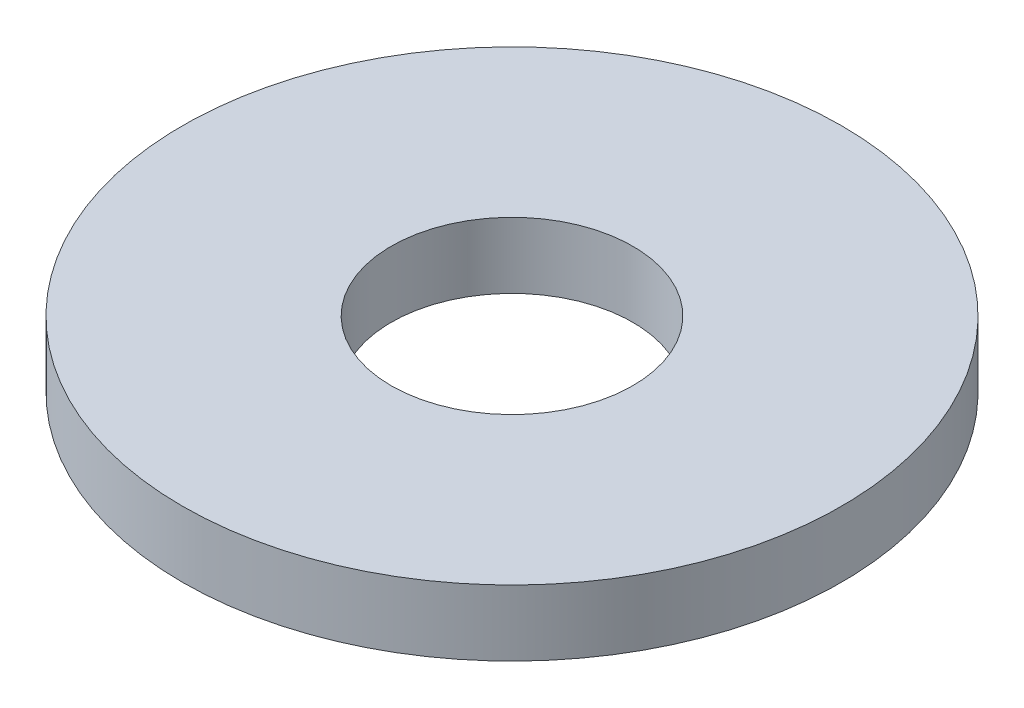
ISO-10303-21;
HEADER;
FILE_DESCRIPTION(('STEP AP214'),'2;1');
FILE_NAME('part.step','',(''),(''),'','','');
FILE_SCHEMA(('AUTOMOTIVE_DESIGN { 1 0 10303 214 1 1 1 1 }'));
ENDSEC;
DATA;
#1=APPLICATION_CONTEXT('core data for automotive mechanical design processes');
#2=APPLICATION_PROTOCOL_DEFINITION('international standard','automotive_design',2000,#1);
#3=PRODUCT_CONTEXT('',#1,'mechanical');
#4=PRODUCT('Part','Part','',(#3));
#5=PRODUCT_RELATED_PRODUCT_CATEGORY('part','',(#4));
#6=PRODUCT_DEFINITION_FORMATION('','',#4);
#7=PRODUCT_DEFINITION_CONTEXT('part definition',#1,'design');
#8=PRODUCT_DEFINITION('design','',#6,#7);
#9=PRODUCT_DEFINITION_SHAPE('','',#8);
#10=(LENGTH_UNIT() NAMED_UNIT(*) SI_UNIT(.MILLI.,.METRE.));
#11=(NAMED_UNIT(*) PLANE_ANGLE_UNIT() SI_UNIT($,.RADIAN.));
#12=(NAMED_UNIT(*) SI_UNIT($,.STERADIAN.) SOLID_ANGLE_UNIT());
#13=UNCERTAINTY_MEASURE_WITH_UNIT(LENGTH_MEASURE(1.E-05),#10,'distance_accuracy_value','');
#14=(GEOMETRIC_REPRESENTATION_CONTEXT(3) GLOBAL_UNCERTAINTY_ASSIGNED_CONTEXT((#13)) GLOBAL_UNIT_ASSIGNED_CONTEXT((#10,
#11,#12)) REPRESENTATION_CONTEXT('',''));
#15=CARTESIAN_POINT('',(0.,0.,0.));
#16=DIRECTION('',(0.,0.,1.));
#17=DIRECTION('',(1.,0.,0.));
#18=AXIS2_PLACEMENT_3D('',#15,#16,#17);
#19=CARTESIAN_POINT('',(0.,0.3,0.));
#20=DIRECTION('',(0.,1.,0.));
#21=DIRECTION('',(0.,0.,1.));
#22=AXIS2_PLACEMENT_3D('',#19,#20,#21);
#23=PLANE('',#22);
#24=CARTESIAN_POINT('',(0.,0.3,0.));
#25=DIRECTION('',(0.,1.,0.));
#26=DIRECTION('',(0.,0.,1.));
#27=AXIS2_PLACEMENT_3D('',#24,#25,#26);
#28=CIRCLE('',#27,1.5);
#29=CARTESIAN_POINT('',(0.,0.3,1.5));
#30=VERTEX_POINT('',#29);
#31=EDGE_CURVE('E10',#30,#30,#28,.T.);
#32=ORIENTED_EDGE('',*,*,#31,.T.);
#33=EDGE_LOOP('',(#32));
#34=FACE_BOUND('',#33,.T.);
#35=CARTESIAN_POINT('',(0.,0.3,0.));
#36=DIRECTION('',(0.,1.,0.));
#37=DIRECTION('',(0.,0.,1.));
#38=AXIS2_PLACEMENT_3D('',#35,#36,#37);
#39=CIRCLE('',#38,0.55);
#40=CARTESIAN_POINT('',(0.,0.3,0.55));
#41=VERTEX_POINT('',#40);
#42=EDGE_CURVE('E39',#41,#41,#39,.T.);
#43=ORIENTED_EDGE('',*,*,#42,.F.);
#44=EDGE_LOOP('',(#43));
#45=FACE_BOUND('',#44,.T.);
#46=ADVANCED_FACE('F28',(#34,#45),#23,.T.);
#47=CARTESIAN_POINT('',(0.,0.,0.));
#48=DIRECTION('',(0.,1.,0.));
#49=DIRECTION('',(0.,0.,1.));
#50=AXIS2_PLACEMENT_3D('',#47,#48,#49);
#51=PLANE('',#50);
#52=CARTESIAN_POINT('',(0.,0.,0.));
#53=DIRECTION('',(0.,1.,0.));
#54=DIRECTION('',(0.,0.,1.));
#55=AXIS2_PLACEMENT_3D('',#52,#53,#54);
#56=CIRCLE('',#55,1.5);
#57=CARTESIAN_POINT('',(0.,0.,1.5));
#58=VERTEX_POINT('',#57);
#59=EDGE_CURVE('E35',#58,#58,#56,.T.);
#60=ORIENTED_EDGE('',*,*,#59,.F.);
#61=EDGE_LOOP('',(#60));
#62=FACE_BOUND('',#61,.T.);
#63=CARTESIAN_POINT('',(0.,0.,0.));
#64=DIRECTION('',(0.,1.,0.));
#65=DIRECTION('',(0.,0.,1.));
#66=AXIS2_PLACEMENT_3D('',#63,#64,#65);
#67=CIRCLE('',#66,0.55);
#68=CARTESIAN_POINT('',(0.,0.,0.55));
#69=VERTEX_POINT('',#68);
#70=EDGE_CURVE('E43',#69,#69,#67,.T.);
#71=ORIENTED_EDGE('',*,*,#70,.T.);
#72=EDGE_LOOP('',(#71));
#73=FACE_BOUND('',#72,.T.);
#74=ADVANCED_FACE('F49',(#62,#73),#51,.F.);
#75=CARTESIAN_POINT('',(0.,0.3,0.));
#76=DIRECTION('',(0.,-1.,0.));
#77=DIRECTION('',(0.,0.,-1.));
#78=AXIS2_PLACEMENT_3D('',#75,#76,#77);
#79=CYLINDRICAL_SURFACE('',#78,1.5);
#80=ORIENTED_EDGE('',*,*,#31,.F.);
#81=EDGE_LOOP('',(#80));
#82=FACE_BOUND('',#81,.T.);
#83=ORIENTED_EDGE('',*,*,#59,.T.);
#84=EDGE_LOOP('',(#83));
#85=FACE_BOUND('',#84,.T.);
#86=ADVANCED_FACE('F30',(#82,#85),#79,.T.);
#87=CARTESIAN_POINT('',(0.,0.3,0.));
#88=DIRECTION('',(0.,-1.,0.));
#89=DIRECTION('',(0.,0.,-1.));
#90=AXIS2_PLACEMENT_3D('',#87,#88,#89);
#91=CYLINDRICAL_SURFACE('',#90,0.55);
#92=ORIENTED_EDGE('',*,*,#42,.T.);
#93=EDGE_LOOP('',(#92));
#94=FACE_BOUND('',#93,.T.);
#95=ORIENTED_EDGE('',*,*,#70,.F.);
#96=EDGE_LOOP('',(#95));
#97=FACE_BOUND('',#96,.T.);
#98=ADVANCED_FACE('F51',(#94,#97),#91,.F.);
#99=CLOSED_SHELL('',(#46,#74,#86,#98));
#100=MANIFOLD_SOLID_BREP('B2',#99);
#101=ADVANCED_BREP_SHAPE_REPRESENTATION('',(#18,#100),#14);
#102=SHAPE_DEFINITION_REPRESENTATION(#9,#101);
ENDSEC;
END-ISO-10303-21;
